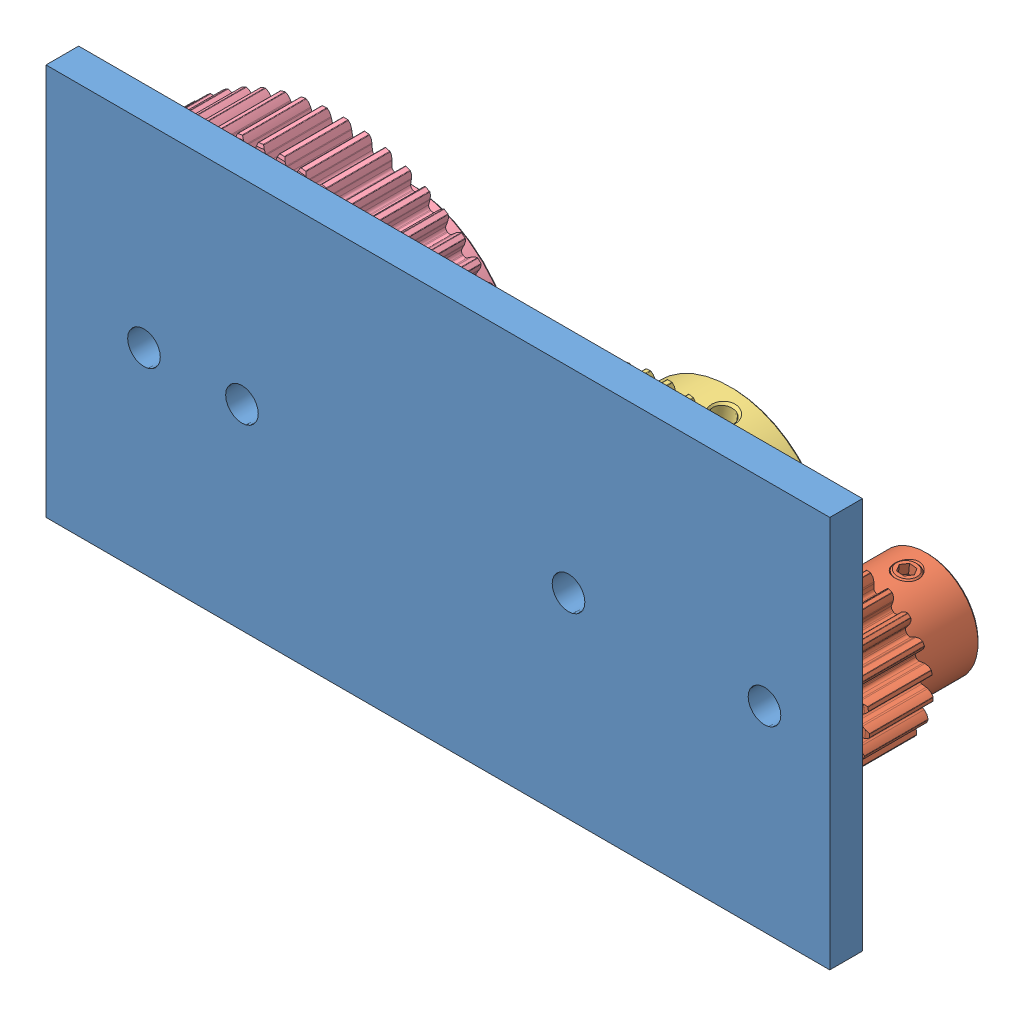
SolidWorks assembly Gear_Assembly.SLDASM, configuration Default (file format 12000). Lengths in mm.
Overall size (127.98 71.91 25).
7 component instances, 5 part files, 15 mates.
Components (placement in the parent):
- Gear_Plate2-1: Gear_Plate2.SLDPRT [Default] at (44.914 67.5186 88.72) size (120 60 5)
- GEABP1.0-20-10-B-10_Gear_20teeth-1: GEABP1.0-20-10-B-10_Gear_20teeth.SLDPRT [Default] at (94.914 67.5186 88.72) x (0.995187 -0.097993 0) z (0 0 1) size (22 22 20)
- GEABP1.0-40-10-B-10_Gear_40teeth-1: GEABP1.0-40-10-B-10_Gear_40teeth.SLDPRT [Default] at (64.914 67.5186 88.72) x (0.982587 -0.185803 0) z (0 0 1) size (42 42 20)
- GEABP1.0-60-10-B-10_Gear_60teeth-1: GEABP1.0-60-10-B-10_Gear_60teeth.SLDPRT [Default] at (14.914 67.5186 88.72) x (0.9845 0.175386 0) z (0 0 1) size (62 62 20)
- SPTR10-20-M6-SC12_Tapped_Shaft_M6_10mm-1: SPTR10-20-M6-SC12_Tapped_Shaft_M6_10mm.SLDPRT [Default] at (14.914 67.5186 68.72) x (0 0 1) z (0 1 0) size (20 10 10)
- SPTR10-20-M6-SC12_Tapped_Shaft_M6_10mm-2: SPTR10-20-M6-SC12_Tapped_Shaft_M6_10mm.SLDPRT [Default] at (64.914 67.5186 68.72) x (0 0 1) z (0 1 0) size (20 10 10)
- SPTR10-20-M6-SC12_Tapped_Shaft_M6_10mm-3: SPTR10-20-M6-SC12_Tapped_Shaft_M6_10mm.SLDPRT [Default] at (94.914 67.5186 68.72) x (0 0 1) z (0 1 0) size (20 10 10)
Mates (geometry in assembly coordinates):
- Concentric1: concentric anti-aligned: circle of Gear_Plate2-1; cylinder of GEABP1.0-20-10-B-10_Gear_20teeth-1 through (94.914 67.5186 68.72) axis (0 0 1) radius 5
- Coincident1: coincident anti-aligned: plane of Gear_Plate2-1 through (44.914 67.5186 88.72) normal (0 0 -1); plane of GEABP1.0-20-10-B-10_Gear_20teeth-1 through (94.914 67.5186 88.72) normal (0 0 1)
- Concentric2: concentric anti-aligned: circle of Gear_Plate2-1; cylinder of GEABP1.0-40-10-B-10_Gear_40teeth-1 through (64.914 67.5186 68.72) axis (0 0 1) radius 5
- Coincident2: coincident anti-aligned: plane of Gear_Plate2-1 through (44.914 67.5186 88.72) normal (0 0 -1); plane of GEABP1.0-40-10-B-10_Gear_40teeth-1 through (64.914 67.5186 88.72) normal (0 0 1)
- Concentric3: concentric anti-aligned: cylinder of Gear_Plate2-1 through (14.914 67.5186 88.72) axis (0 0 -1) radius 2.5; cylinder of GEABP1.0-60-10-B-10_Gear_60teeth-1 through (14.914 67.5186 68.72) axis (0 0 1) radius 5
- Coincident3: coincident anti-aligned: plane of Gear_Plate2-1 through (44.914 67.5186 88.72) normal (0 0 -1); plane of GEABP1.0-60-10-B-10_Gear_60teeth-1 through (14.914 67.5186 88.72) normal (0 0 1)
- Concentric4: concentric anti-aligned: cylinder of Gear_Plate2-1 through (14.914 67.5186 88.72) axis (0 0 -1) radius 2.5; cylinder of SPTR10-20-M6-SC12_Tapped_Shaft_M6_10mm-1 through (14.914 67.5186 88.72) axis (0 0 1) radius 2.4585
- Coincident4: coincident anti-aligned: plane of Gear_Plate2-1 through (44.914 67.5186 88.72) normal (0 0 -1); plane of SPTR10-20-M6-SC12_Tapped_Shaft_M6_10mm-1 through (19.914 67.5186 88.72) normal (0 0 1)
- Parallel1: parallel aligned: plane of Gear_Plate2-1 through (-15.086 97.5186 93.72) normal (0 1 0); plane of SPTR10-20-M6-SC12_Tapped_Shaft_M6_10mm-1 through (11.914 71.5186 80.72) normal (0 1 0)
- Concentric5: concentric anti-aligned: cylinder of Gear_Plate2-1 through (64.914 67.5186 88.72) axis (0 0 -1) radius 2.5; cylinder of SPTR10-20-M6-SC12_Tapped_Shaft_M6_10mm-2 through (64.914 67.5186 88.72) axis (0 0 1) radius 2.4585
- Coincident6: coincident anti-aligned: plane of Gear_Plate2-1 through (44.914 67.5186 88.72) normal (0 0 -1); plane of SPTR10-20-M6-SC12_Tapped_Shaft_M6_10mm-2 through (69.914 67.5186 88.72) normal (0 0 1)
- Parallel2: parallel aligned: plane of Gear_Plate2-1 through (-15.086 97.5186 93.72) normal (0 1 0); plane of SPTR10-20-M6-SC12_Tapped_Shaft_M6_10mm-2 through (61.914 71.5186 80.72) normal (0 1 0)
- Coincident8: coincident anti-aligned: plane of Gear_Plate2-1 through (44.914 67.5186 88.72) normal (0 0 -1); plane of SPTR10-20-M6-SC12_Tapped_Shaft_M6_10mm-3 through (99.914 67.5186 88.72) normal (0 0 1)
- Concentric6: concentric anti-aligned: cylinder of Gear_Plate2-1 through (94.914 67.5186 88.72) axis (0 0 -1) radius 2.5; cylinder of SPTR10-20-M6-SC12_Tapped_Shaft_M6_10mm-3 through (94.914 67.5186 88.72) axis (0 0 1) radius 2.4585
- Parallel3: parallel aligned: plane of Gear_Plate2-1 through (-15.086 97.5186 93.72) normal (0 1 0); plane of SPTR10-20-M6-SC12_Tapped_Shaft_M6_10mm-3 through (91.914 71.5186 80.72) normal (0 1 0)
